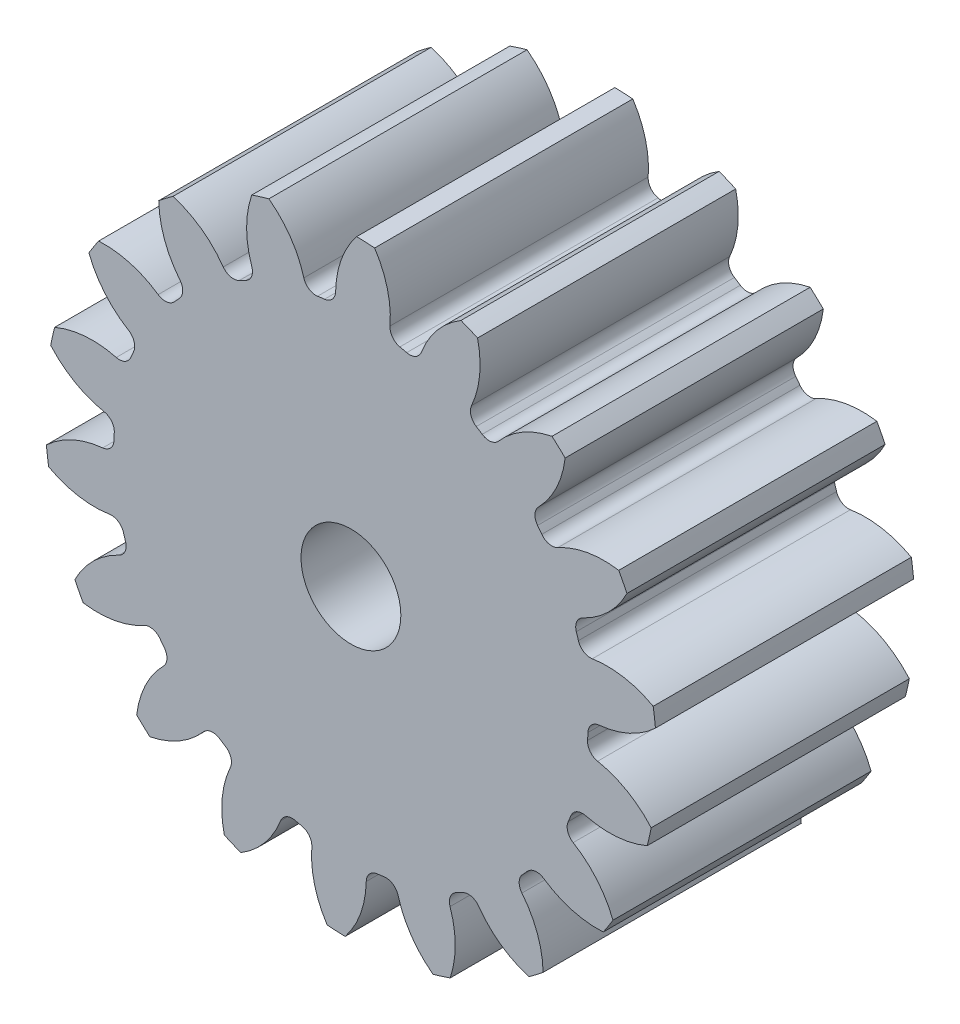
from build123d import *

# Parameters (mm, degrees)
SKETCH3_R         = 112.888888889
GEARBODY_DEPTH    = 95.25
TOOTHCUT_DEPTH    = 186.904182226
CIRPATTERN1_COUNT = 18
BOREDIA_R         = 18.415
BORE_DEPTH        = 12700


with BuildPart() as part:
    # Sketch3 → gearBody (new body)
    with BuildSketch(Plane.XY):
        Circle(SKETCH3_R)
    extrude(amount=GEARBODY_DEPTH)

    # Sketch2 → toothCut (cut, through all)
    with BuildSketch(Plane.XY):
        with BuildLine():
            ThreePointArc((87.315061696, -5.512320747), (87.38713755, -4.218278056), (87.440036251, -2.923309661))
            ThreePointArc((87.440036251, -2.923309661), (88.682662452, 0.068285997), (91.590254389, 1.49645741))
            ThreePointArc((91.590254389, 1.49645741), (103.093743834, 4.636758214), (112.888888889, 11.437264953))
            ThreePointArc((112.888888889, 11.437264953), (113.334825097, -5.470802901), (111.262412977, -22.257307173))
            ThreePointArc((111.262412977, -22.257307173), (102.167819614, -14.544970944), (91.020281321, -10.311278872))
            ThreePointArc((91.020281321, -10.311278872), (88.263766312, -8.609694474), (87.315061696, -5.512320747))
        make_face()
    toothcut = extrude(amount=TOOTHCUT_DEPTH, mode=Mode.SUBTRACT)

    # CirPattern1: toothCut ×18 about axis
    cirpattern1_axis = Axis((0, 0, 0), (0, 0, 1))
    for i in range(1, CIRPATTERN1_COUNT):
        add(toothcut.rotate(cirpattern1_axis, i * 360 / CIRPATTERN1_COUNT), mode=Mode.SUBTRACT)

    # boreDia → bore (cut, symmetric)
    with BuildSketch(Plane.XY):
        Circle(BOREDIA_R)
    extrude(amount=BORE_DEPTH, both=True, mode=Mode.SUBTRACT)


solid = part.part
